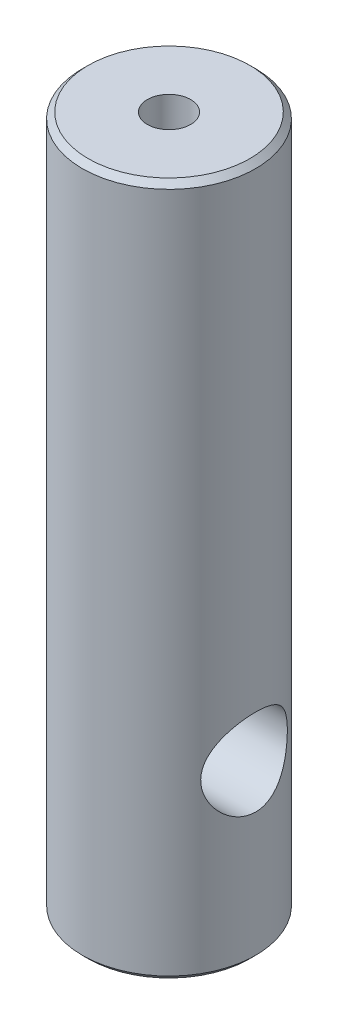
ISO-10303-21;
HEADER;
FILE_DESCRIPTION(('STEP AP214'),'2;1');
FILE_NAME('part.step','',(''),(''),'','','');
FILE_SCHEMA(('AUTOMOTIVE_DESIGN { 1 0 10303 214 1 1 1 1 }'));
ENDSEC;
DATA;
#1=APPLICATION_CONTEXT('core data for automotive mechanical design processes');
#2=APPLICATION_PROTOCOL_DEFINITION('international standard','automotive_design',2000,#1);
#3=PRODUCT_CONTEXT('',#1,'mechanical');
#4=PRODUCT('Part','Part','',(#3));
#5=PRODUCT_RELATED_PRODUCT_CATEGORY('part','',(#4));
#6=PRODUCT_DEFINITION_FORMATION('','',#4);
#7=PRODUCT_DEFINITION_CONTEXT('part definition',#1,'design');
#8=PRODUCT_DEFINITION('design','',#6,#7);
#9=PRODUCT_DEFINITION_SHAPE('','',#8);
#10=(LENGTH_UNIT() NAMED_UNIT(*) SI_UNIT(.MILLI.,.METRE.));
#11=(NAMED_UNIT(*) PLANE_ANGLE_UNIT() SI_UNIT($,.RADIAN.));
#12=(NAMED_UNIT(*) SI_UNIT($,.STERADIAN.) SOLID_ANGLE_UNIT());
#13=UNCERTAINTY_MEASURE_WITH_UNIT(LENGTH_MEASURE(1.E-05),#10,'distance_accuracy_value','');
#14=(GEOMETRIC_REPRESENTATION_CONTEXT(3) GLOBAL_UNCERTAINTY_ASSIGNED_CONTEXT((#13)) GLOBAL_UNIT_ASSIGNED_CONTEXT((#10,
#11,#12)) REPRESENTATION_CONTEXT('',''));
#15=CARTESIAN_POINT('',(0.,0.,0.));
#16=DIRECTION('',(0.,0.,1.));
#17=DIRECTION('',(1.,0.,0.));
#18=AXIS2_PLACEMENT_3D('',#15,#16,#17);
#19=CARTESIAN_POINT('',(0.,76.2,0.));
#20=DIRECTION('',(0.,-1.,0.));
#21=DIRECTION('',(0.,0.,-1.));
#22=AXIS2_PLACEMENT_3D('',#19,#20,#21);
#23=CYLINDRICAL_SURFACE('',#22,9.525);
#24=CARTESIAN_POINT('',(0.,0.635000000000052,0.));
#25=DIRECTION('',(0.,1.,0.));
#26=DIRECTION('',(0.,0.,1.));
#27=AXIS2_PLACEMENT_3D('',#24,#25,#26);
#28=CIRCLE('',#27,9.525);
#29=CARTESIAN_POINT('',(0.,0.635000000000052,9.525));
#30=VERTEX_POINT('',#29);
#31=EDGE_CURVE('E42',#30,#30,#28,.T.);
#32=ORIENTED_EDGE('',*,*,#31,.T.);
#33=EDGE_LOOP('',(#32));
#34=FACE_BOUND('',#33,.T.);
#35=CARTESIAN_POINT('',(0.,75.565,0.));
#36=DIRECTION('',(0.,1.,0.));
#37=DIRECTION('',(0.,0.,1.));
#38=AXIS2_PLACEMENT_3D('',#35,#36,#37);
#39=CIRCLE('',#38,9.525);
#40=CARTESIAN_POINT('',(0.,75.565,9.525));
#41=VERTEX_POINT('',#40);
#42=EDGE_CURVE('E46',#41,#41,#39,.F.);
#43=ORIENTED_EDGE('',*,*,#42,.T.);
#44=EDGE_LOOP('',(#43));
#45=FACE_BOUND('',#44,.T.);
#46=CARTESIAN_POINT('',(-8.24889197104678,19.05,-4.7625));
#47=CARTESIAN_POINT('',(-8.24889272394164,19.1741409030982,-4.76249940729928));
#48=CARTESIAN_POINT('',(-8.25170408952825,19.2982928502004,-4.75763943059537));
#49=CARTESIAN_POINT('',(-8.26284430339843,19.5456383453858,-4.73826449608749));
#50=CARTESIAN_POINT('',(-8.27117572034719,19.6688314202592,-4.72374504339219));
#51=CARTESIAN_POINT('',(-8.29306424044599,19.9134541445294,-4.68521103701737));
#52=CARTESIAN_POINT('',(-8.30662953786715,20.0348807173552,-4.66118159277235));
#53=CARTESIAN_POINT('',(-8.33849424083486,20.2749316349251,-4.60393332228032));
#54=CARTESIAN_POINT('',(-8.35679570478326,20.3935547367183,-4.57071050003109));
#55=CARTESIAN_POINT('',(-8.41767757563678,20.7426984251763,-4.45820926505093));
#56=CARTESIAN_POINT('',(-8.46639036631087,20.9680800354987,-4.36584227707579));
#57=CARTESIAN_POINT('',(-8.57453511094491,21.3999717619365,-4.14940045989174));
#58=CARTESIAN_POINT('',(-8.63396764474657,21.6064808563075,-4.02532391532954));
#59=CARTESIAN_POINT('',(-8.76284791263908,22.0137138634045,-3.73698658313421));
#60=CARTESIAN_POINT('',(-8.83271738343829,22.2125558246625,-3.57025552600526));
#61=CARTESIAN_POINT('',(-8.97122433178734,22.5809832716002,-3.20633353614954));
#62=CARTESIAN_POINT('',(-9.03986117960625,22.7505541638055,-3.00912750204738));
#63=CARTESIAN_POINT('',(-9.13908932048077,22.9849931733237,-2.68636629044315));
#64=CARTESIAN_POINT('',(-9.17251360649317,23.0618472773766,-2.57020878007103));
#65=CARTESIAN_POINT('',(-9.23620349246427,23.205403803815,-2.33097830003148));
#66=CARTESIAN_POINT('',(-9.26647034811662,23.2721102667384,-2.20790810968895));
#67=CARTESIAN_POINT('',(-9.32297018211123,23.3947108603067,-1.95564815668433));
#68=CARTESIAN_POINT('',(-9.34920419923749,23.4506077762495,-1.8264599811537));
#69=CARTESIAN_POINT('',(-9.39686248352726,23.5509730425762,-1.56285911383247));
#70=CARTESIAN_POINT('',(-9.41828726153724,23.5954426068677,-1.42844697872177));
#71=CARTESIAN_POINT('',(-9.45432792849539,23.6696397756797,-1.16519740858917));
#72=CARTESIAN_POINT('',(-9.46931966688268,23.7001908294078,-1.03664325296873));
#73=CARTESIAN_POINT('',(-9.49415396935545,23.7505555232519,-0.776963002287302));
#74=CARTESIAN_POINT('',(-9.50399703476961,23.7703702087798,-0.645837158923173));
#75=CARTESIAN_POINT('',(-9.51824582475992,23.7989934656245,-0.382159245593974));
#76=CARTESIAN_POINT('',(-9.52265417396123,23.8078073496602,-0.249607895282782));
#77=CARTESIAN_POINT('',(-9.52591136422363,23.8143234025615,0.0158324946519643));
#78=CARTESIAN_POINT('',(-9.52476054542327,23.8120262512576,0.148721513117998));
#79=CARTESIAN_POINT('',(-9.51727773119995,23.7970403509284,0.402105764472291));
#80=CARTESIAN_POINT('',(-9.5114066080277,23.7852758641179,0.522670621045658));
#81=CARTESIAN_POINT('',(-9.49520689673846,23.75265197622,0.762297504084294));
#82=CARTESIAN_POINT('',(-9.48487690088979,23.7317897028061,0.881359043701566));
#83=CARTESIAN_POINT('',(-9.4600084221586,23.6812014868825,1.11709538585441));
#84=CARTESIAN_POINT('',(-9.44547134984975,23.6514785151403,1.23377097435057));
#85=CARTESIAN_POINT('',(-9.41253030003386,23.583473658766,1.46405663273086));
#86=CARTESIAN_POINT('',(-9.39412483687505,23.5451884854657,1.57766550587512));
#87=CARTESIAN_POINT('',(-9.33315909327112,23.4168557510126,1.91586173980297));
#88=CARTESIAN_POINT('',(-9.28518547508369,23.313991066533,2.13476891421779));
#89=CARTESIAN_POINT('',(-9.1791264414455,23.0778084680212,2.55262754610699));
#90=CARTESIAN_POINT('',(-9.12103740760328,22.9444796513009,2.75157182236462));
#91=CARTESIAN_POINT('',(-8.99371794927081,22.6366735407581,3.14406030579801));
#92=CARTESIAN_POINT('',(-8.92395340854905,22.4594979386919,3.33531640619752));
#93=CARTESIAN_POINT('',(-8.78462733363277,22.076102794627,3.68669670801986));
#94=CARTESIAN_POINT('',(-8.71506599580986,21.8698611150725,3.84679695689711));
#95=CARTESIAN_POINT('',(-8.61432292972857,21.5348864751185,4.06522723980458));
#96=CARTESIAN_POINT('',(-8.58040455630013,21.415005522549,4.13613898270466));
#97=CARTESIAN_POINT('',(-8.51583950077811,21.1688193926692,4.2674875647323));
#98=CARTESIAN_POINT('',(-8.48519134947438,21.0425171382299,4.32792911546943));
#99=CARTESIAN_POINT('',(-8.42829064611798,20.7842774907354,4.43772127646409));
#100=CARTESIAN_POINT('',(-8.40203655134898,20.6523420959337,4.48707578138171));
#101=CARTESIAN_POINT('',(-8.35498507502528,20.3837946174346,4.57409004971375));
#102=CARTESIAN_POINT('',(-8.334184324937,20.2471854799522,4.61175703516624));
#103=CARTESIAN_POINT('',(-8.30033105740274,19.9812748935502,4.67239107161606));
#104=CARTESIAN_POINT('',(-8.28679731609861,19.8522453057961,4.69628224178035));
#105=CARTESIAN_POINT('',(-8.26567972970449,19.5922327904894,4.73335209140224));
#106=CARTESIAN_POINT('',(-8.25809279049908,19.4612509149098,4.74653634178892));
#107=CARTESIAN_POINT('',(-8.24918359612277,19.1984800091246,4.76200330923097));
#108=CARTESIAN_POINT('',(-8.24785900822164,19.0666912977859,4.76429008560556));
#109=CARTESIAN_POINT('',(-8.25152581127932,18.8034730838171,4.75793657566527));
#110=CARTESIAN_POINT('',(-8.25651677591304,18.6720435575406,4.74929702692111));
#111=CARTESIAN_POINT('',(-8.27171481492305,18.4250764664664,4.72277057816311));
#112=CARTESIAN_POINT('',(-8.28128924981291,18.3093779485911,4.70600273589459));
#113=CARTESIAN_POINT('',(-8.30494741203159,18.07995796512,4.66412284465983));
#114=CARTESIAN_POINT('',(-8.3190325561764,17.9662371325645,4.63900817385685));
#115=CARTESIAN_POINT('',(-8.36742301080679,17.62914618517,4.55152408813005));
#116=CARTESIAN_POINT('',(-8.40787423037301,17.4096861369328,4.47699683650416));
#117=CARTESIAN_POINT('',(-8.50278882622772,16.9763186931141,4.29409140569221));
#118=CARTESIAN_POINT('',(-8.55781440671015,16.763139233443,4.18430528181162));
#119=CARTESIAN_POINT('',(-8.67518529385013,16.3569607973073,3.93519108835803));
#120=CARTESIAN_POINT('',(-8.73753435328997,16.1639722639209,3.79584784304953));
#121=CARTESIAN_POINT('',(-8.87196405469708,15.7782659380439,3.47109765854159));
#122=CARTESIAN_POINT('',(-8.94428069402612,15.5886488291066,3.28209830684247));
#123=CARTESIAN_POINT('',(-9.08372577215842,15.2427789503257,2.87366994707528));
#124=CARTESIAN_POINT('',(-9.15085245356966,15.0865374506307,2.65423070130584));
#125=CARTESIAN_POINT('',(-9.24324496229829,14.8789934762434,2.30289806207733));
#126=CARTESIAN_POINT('',(-9.27299632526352,14.8136018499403,2.18030840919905));
#127=CARTESIAN_POINT('',(-9.32847745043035,14.693496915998,1.9291530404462));
#128=CARTESIAN_POINT('',(-9.35420899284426,14.6387788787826,1.80059000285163));
#129=CARTESIAN_POINT('',(-9.40087915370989,14.5406574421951,1.53844708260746));
#130=CARTESIAN_POINT('',(-9.4218200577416,14.4972486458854,1.40486962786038));
#131=CARTESIAN_POINT('',(-9.45827821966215,14.4222701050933,1.13371049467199));
#132=CARTESIAN_POINT('',(-9.47379612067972,14.3906989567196,0.996129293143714));
#133=CARTESIAN_POINT('',(-9.49775785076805,14.3421782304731,0.730949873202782));
#134=CARTESIAN_POINT('',(-9.50672024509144,14.3241525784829,0.603594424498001));
#135=CARTESIAN_POINT('',(-9.51951815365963,14.2984599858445,0.347590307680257));
#136=CARTESIAN_POINT('',(-9.52335406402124,14.2907922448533,0.218941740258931));
#137=CARTESIAN_POINT('',(-9.52579195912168,14.2859158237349,-0.0385649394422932));
#138=CARTESIAN_POINT('',(-9.52439546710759,14.2887040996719,-0.16742297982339));
#139=CARTESIAN_POINT('',(-9.51641162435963,14.3046950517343,-0.424324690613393));
#140=CARTESIAN_POINT('',(-9.50982441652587,14.3178974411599,-0.55236838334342));
#141=CARTESIAN_POINT('',(-9.49224229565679,14.353334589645,-0.798199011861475));
#142=CARTESIAN_POINT('',(-9.48156800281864,14.3749136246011,-0.916103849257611));
#143=CARTESIAN_POINT('',(-9.45610870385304,14.4267680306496,-1.14954398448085));
#144=CARTESIAN_POINT('',(-9.44132238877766,14.4570461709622,-1.26507851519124));
#145=CARTESIAN_POINT('',(-9.39128133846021,14.5604943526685,-1.60695881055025));
#146=CARTESIAN_POINT('',(-9.35032881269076,14.6463085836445,-1.82878870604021));
#147=CARTESIAN_POINT('',(-9.25477034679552,14.8529442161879,-2.26424000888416));
#148=CARTESIAN_POINT('',(-9.1996553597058,14.9751059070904,-2.47710454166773));
#149=CARTESIAN_POINT('',(-9.08152237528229,15.2493252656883,-2.88023067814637));
#150=CARTESIAN_POINT('',(-9.01850075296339,15.401396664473,-3.07048183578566));
#151=CARTESIAN_POINT('',(-8.88342722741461,15.7486113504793,-3.44287591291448));
#152=CARTESIAN_POINT('',(-8.81110081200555,15.9465350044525,-3.62232759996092));
#153=CARTESIAN_POINT('',(-8.67074486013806,16.3709004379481,-3.94652779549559));
#154=CARTESIAN_POINT('',(-8.60271916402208,16.5973671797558,-4.09124560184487));
#155=CARTESIAN_POINT('',(-8.50907579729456,16.9585192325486,-4.28094082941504));
#156=CARTESIAN_POINT('',(-8.47885685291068,17.084636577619,-4.34031088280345));
#157=CARTESIAN_POINT('',(-8.42284293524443,17.342410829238,-4.44803619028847));
#158=CARTESIAN_POINT('',(-8.39704568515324,17.4740648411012,-4.49639711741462));
#159=CARTESIAN_POINT('',(-8.35096779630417,17.7416535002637,-4.58140792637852));
#160=CARTESIAN_POINT('',(-8.33067298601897,17.8775761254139,-4.61808793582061));
#161=CARTESIAN_POINT('',(-8.29641582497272,18.1528327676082,-4.67935352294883));
#162=CARTESIAN_POINT('',(-8.28244904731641,18.292164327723,-4.70394755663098));
#163=CARTESIAN_POINT('',(-8.26434282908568,18.5346954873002,-4.73566148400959));
#164=CARTESIAN_POINT('',(-8.25856285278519,18.637400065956,-4.74571628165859));
#165=CARTESIAN_POINT('',(-8.25083698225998,18.843400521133,-4.7591360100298));
#166=CARTESIAN_POINT('',(-8.24889134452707,18.9466964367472,-4.76250049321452));
#167=CARTESIAN_POINT('',(-8.24889197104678,19.05,-4.7625));
#168=B_SPLINE_CURVE_WITH_KNOTS('',3,(#46,#47,#48,#49,#50,#51,#52,#53,#54,#55,#56,#57,#58,#59,
#60,#61,#62,#63,#64,#65,#66,#67,#68,#69,#70,#71,#72,#73,#74,#75,#76,#77,#78,#79,#80,#81,#82,#83,
#84,#85,#86,#87,#88,#89,#90,#91,#92,#93,#94,#95,#96,#97,#98,#99,#100,#101,#102,#103,#104,#105,
#106,#107,#108,#109,#110,#111,#112,#113,#114,#115,#116,#117,#118,#119,#120,#121,#122,#123,#124,
#125,#126,#127,#128,#129,#130,#131,#132,#133,#134,#135,#136,#137,#138,#139,#140,#141,#142,#143,
#144,#145,#146,#147,#148,#149,#150,#151,#152,#153,#154,#155,#156,#157,#158,#159,#160,#161,#162,
#163,#164,#165,#166,#167),.UNSPECIFIED.,.T.,.F.,(4,2,2,2,2,2,2,2,2,2,2,2,2,2,2,2,2,2,2,2,2,2,2,
2,2,2,2,2,2,2,2,2,2,2,2,2,2,2,2,2,2,2,2,2,2,2,2,2,2,2,2,2,2,2,2,2,2,2,2,2,4),(0.,
0.372315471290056,0.74480431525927,1.11787871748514,1.49111553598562,2.23280682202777,
2.97453823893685,3.77744614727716,4.58075320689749,5.00998800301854,5.43905143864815,
5.8680041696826,6.29691131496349,6.69531812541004,7.09368613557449,7.49186168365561,
7.8900128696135,8.25342137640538,8.61694470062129,8.98034628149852,9.3438876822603,
10.0802760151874,10.8169283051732,11.6232144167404,12.4301179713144,12.8597106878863,
13.2891095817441,13.7183573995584,14.1473394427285,14.5425345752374,14.9375239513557,
15.3323661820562,15.7271817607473,16.0786628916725,16.4302545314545,17.1329551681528,
17.8682015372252,18.603826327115,19.432180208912,20.2608133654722,20.6865967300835,
21.1121909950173,21.5375817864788,21.9629221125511,22.3492223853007,22.735492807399,
23.1216507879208,23.5077981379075,23.8683853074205,24.2290873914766,24.9498683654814,
25.7014774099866,26.4534323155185,27.2802219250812,28.1077396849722,28.5351353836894,
28.9623103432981,29.388374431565,29.8141399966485,30.1239407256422,30.4337621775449),.UNSPECIFIED.);
#169=CARTESIAN_POINT('',(-8.24889197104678,19.05,-4.7625));
#170=VERTEX_POINT('',#169);
#171=EDGE_CURVE('E52',#170,#170,#168,.T.);
#172=ORIENTED_EDGE('',*,*,#171,.T.);
#173=EDGE_LOOP('',(#172));
#174=FACE_BOUND('',#173,.T.);
#175=CARTESIAN_POINT('',(8.24889197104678,19.05,-4.7625));
#176=CARTESIAN_POINT('',(8.24889272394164,18.9258590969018,-4.76249940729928));
#177=CARTESIAN_POINT('',(8.25170408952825,18.8017071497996,-4.75763943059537));
#178=CARTESIAN_POINT('',(8.26284430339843,18.5543616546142,-4.73826449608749));
#179=CARTESIAN_POINT('',(8.27117572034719,18.4311685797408,-4.72374504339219));
#180=CARTESIAN_POINT('',(8.29306424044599,18.1865458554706,-4.68521103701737));
#181=CARTESIAN_POINT('',(8.30662953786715,18.0651192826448,-4.66118159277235));
#182=CARTESIAN_POINT('',(8.33849424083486,17.8250683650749,-4.60393332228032));
#183=CARTESIAN_POINT('',(8.35679570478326,17.7064452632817,-4.57071050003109));
#184=CARTESIAN_POINT('',(8.41767757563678,17.3573015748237,-4.45820926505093));
#185=CARTESIAN_POINT('',(8.46639036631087,17.1319199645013,-4.36584227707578));
#186=CARTESIAN_POINT('',(8.57453511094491,16.7000282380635,-4.14940045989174));
#187=CARTESIAN_POINT('',(8.63396764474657,16.4935191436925,-4.02532391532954));
#188=CARTESIAN_POINT('',(8.76284791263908,16.0862861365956,-3.73698658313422));
#189=CARTESIAN_POINT('',(8.83271738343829,15.8874441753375,-3.57025552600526));
#190=CARTESIAN_POINT('',(8.97122433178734,15.5190167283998,-3.20633353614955));
#191=CARTESIAN_POINT('',(9.03986117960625,15.3494458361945,-3.00912750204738));
#192=CARTESIAN_POINT('',(9.13908932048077,15.1150068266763,-2.68636629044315));
#193=CARTESIAN_POINT('',(9.17251360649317,15.0381527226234,-2.57020878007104));
#194=CARTESIAN_POINT('',(9.23620349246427,14.894596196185,-2.33097830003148));
#195=CARTESIAN_POINT('',(9.26647034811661,14.8278897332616,-2.20790810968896));
#196=CARTESIAN_POINT('',(9.32297018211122,14.7052891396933,-1.95564815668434));
#197=CARTESIAN_POINT('',(9.34920419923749,14.6493922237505,-1.82645998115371));
#198=CARTESIAN_POINT('',(9.39686248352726,14.5490269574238,-1.56285911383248));
#199=CARTESIAN_POINT('',(9.41828726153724,14.5045573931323,-1.42844697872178));
#200=CARTESIAN_POINT('',(9.45432792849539,14.4303602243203,-1.16519740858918));
#201=CARTESIAN_POINT('',(9.46931966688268,14.3998091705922,-1.03664325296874));
#202=CARTESIAN_POINT('',(9.49415396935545,14.3494444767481,-0.776963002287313));
#203=CARTESIAN_POINT('',(9.50399703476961,14.3296297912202,-0.645837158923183));
#204=CARTESIAN_POINT('',(9.51824582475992,14.3010065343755,-0.382159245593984));
#205=CARTESIAN_POINT('',(9.52265417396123,14.2921926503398,-0.249607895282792));
#206=CARTESIAN_POINT('',(9.52591136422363,14.2856765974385,0.0158324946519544));
#207=CARTESIAN_POINT('',(9.52476054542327,14.2879737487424,0.148721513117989));
#208=CARTESIAN_POINT('',(9.51727773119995,14.3029596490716,0.402105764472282));
#209=CARTESIAN_POINT('',(9.5114066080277,14.314724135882,0.522670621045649));
#210=CARTESIAN_POINT('',(9.49520689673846,14.34734802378,0.762297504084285));
#211=CARTESIAN_POINT('',(9.48487690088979,14.3682102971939,0.881359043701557));
#212=CARTESIAN_POINT('',(9.4600084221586,14.4187985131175,1.1170953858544));
#213=CARTESIAN_POINT('',(9.44547134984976,14.4485214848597,1.23377097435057));
#214=CARTESIAN_POINT('',(9.41253030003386,14.516526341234,1.46405663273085));
#215=CARTESIAN_POINT('',(9.39412483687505,14.5548115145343,1.57766550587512));
#216=CARTESIAN_POINT('',(9.33315909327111,14.6831442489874,1.91586173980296));
#217=CARTESIAN_POINT('',(9.28518547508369,14.786008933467,2.13476891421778));
#218=CARTESIAN_POINT('',(9.1791264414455,15.0221915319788,2.55262754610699));
#219=CARTESIAN_POINT('',(9.12103740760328,15.1555203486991,2.75157182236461));
#220=CARTESIAN_POINT('',(8.99371794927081,15.4633264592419,3.14406030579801));
#221=CARTESIAN_POINT('',(8.92395340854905,15.6405020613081,3.33531640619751));
#222=CARTESIAN_POINT('',(8.78462733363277,16.023897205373,3.68669670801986));
#223=CARTESIAN_POINT('',(8.71506599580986,16.2301388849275,3.84679695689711));
#224=CARTESIAN_POINT('',(8.61432292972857,16.5651135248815,4.06522723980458));
#225=CARTESIAN_POINT('',(8.58040455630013,16.684994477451,4.13613898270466));
#226=CARTESIAN_POINT('',(8.51583950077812,16.9311806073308,4.2674875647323));
#227=CARTESIAN_POINT('',(8.48519134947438,17.0574828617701,4.32792911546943));
#228=CARTESIAN_POINT('',(8.42829064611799,17.3157225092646,4.43772127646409));
#229=CARTESIAN_POINT('',(8.40203655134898,17.4476579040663,4.48707578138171));
#230=CARTESIAN_POINT('',(8.35498507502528,17.7162053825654,4.57409004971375));
#231=CARTESIAN_POINT('',(8.33418432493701,17.8528145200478,4.61175703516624));
#232=CARTESIAN_POINT('',(8.30033105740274,18.1187251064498,4.67239107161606));
#233=CARTESIAN_POINT('',(8.28679731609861,18.2477546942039,4.69628224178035));
#234=CARTESIAN_POINT('',(8.26567972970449,18.5077672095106,4.73335209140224));
#235=CARTESIAN_POINT('',(8.25809279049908,18.6387490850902,4.74653634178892));
#236=CARTESIAN_POINT('',(8.24918359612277,18.9015199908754,4.76200330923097));
#237=CARTESIAN_POINT('',(8.24785900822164,19.033308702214,4.76429008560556));
#238=CARTESIAN_POINT('',(8.25152581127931,19.2965269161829,4.75793657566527));
#239=CARTESIAN_POINT('',(8.25651677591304,19.4279564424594,4.74929702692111));
#240=CARTESIAN_POINT('',(8.27171481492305,19.6749235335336,4.72277057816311));
#241=CARTESIAN_POINT('',(8.28128924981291,19.7906220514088,4.70600273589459));
#242=CARTESIAN_POINT('',(8.30494741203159,20.02004203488,4.66412284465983));
#243=CARTESIAN_POINT('',(8.3190325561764,20.1337628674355,4.63900817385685));
#244=CARTESIAN_POINT('',(8.36742301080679,20.47085381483,4.55152408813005));
#245=CARTESIAN_POINT('',(8.40787423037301,20.6903138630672,4.47699683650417));
#246=CARTESIAN_POINT('',(8.50278882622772,21.1236813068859,4.29409140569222));
#247=CARTESIAN_POINT('',(8.55781440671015,21.336860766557,4.18430528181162));
#248=CARTESIAN_POINT('',(8.67518529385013,21.7430392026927,3.93519108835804));
#249=CARTESIAN_POINT('',(8.73753435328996,21.9360277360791,3.79584784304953));
#250=CARTESIAN_POINT('',(8.87196405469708,22.3217340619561,3.4710976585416));
#251=CARTESIAN_POINT('',(8.94428069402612,22.5113511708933,3.28209830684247));
#252=CARTESIAN_POINT('',(9.08372577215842,22.8572210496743,2.87366994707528));
#253=CARTESIAN_POINT('',(9.15085245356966,23.0134625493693,2.65423070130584));
#254=CARTESIAN_POINT('',(9.24324496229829,23.2210065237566,2.30289806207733));
#255=CARTESIAN_POINT('',(9.27299632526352,23.2863981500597,2.18030840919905));
#256=CARTESIAN_POINT('',(9.32847745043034,23.406503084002,1.92915304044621));
#257=CARTESIAN_POINT('',(9.35420899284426,23.4612211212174,1.80059000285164));
#258=CARTESIAN_POINT('',(9.40087915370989,23.5593425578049,1.53844708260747));
#259=CARTESIAN_POINT('',(9.4218200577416,23.6027513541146,1.40486962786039));
#260=CARTESIAN_POINT('',(9.45827821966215,23.6777298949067,1.13371049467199));
#261=CARTESIAN_POINT('',(9.47379612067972,23.7093010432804,0.996129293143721));
#262=CARTESIAN_POINT('',(9.49775785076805,23.7578217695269,0.730949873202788));
#263=CARTESIAN_POINT('',(9.50672024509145,23.7758474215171,0.603594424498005));
#264=CARTESIAN_POINT('',(9.51951815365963,23.8015400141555,0.34759030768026));
#265=CARTESIAN_POINT('',(9.52335406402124,23.8092077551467,0.218941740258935));
#266=CARTESIAN_POINT('',(9.52579195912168,23.8140841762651,-0.03856493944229));
#267=CARTESIAN_POINT('',(9.52439546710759,23.8112959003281,-0.167422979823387));
#268=CARTESIAN_POINT('',(9.51641162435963,23.7953049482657,-0.424324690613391));
#269=CARTESIAN_POINT('',(9.50982441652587,23.7821025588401,-0.552368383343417));
#270=CARTESIAN_POINT('',(9.49224229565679,23.746665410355,-0.79819901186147));
#271=CARTESIAN_POINT('',(9.48156800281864,23.7250863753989,-0.916103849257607));
#272=CARTESIAN_POINT('',(9.45610870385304,23.6732319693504,-1.14954398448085));
#273=CARTESIAN_POINT('',(9.44132238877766,23.6429538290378,-1.26507851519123));
#274=CARTESIAN_POINT('',(9.39128133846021,23.5395056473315,-1.60695881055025));
#275=CARTESIAN_POINT('',(9.35032881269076,23.4536914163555,-1.82878870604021));
#276=CARTESIAN_POINT('',(9.25477034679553,23.2470557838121,-2.26424000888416));
#277=CARTESIAN_POINT('',(9.1996553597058,23.1248940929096,-2.47710454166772));
#278=CARTESIAN_POINT('',(9.08152237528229,22.8506747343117,-2.88023067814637));
#279=CARTESIAN_POINT('',(9.01850075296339,22.698603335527,-3.07048183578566));
#280=CARTESIAN_POINT('',(8.88342722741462,22.3513886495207,-3.44287591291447));
#281=CARTESIAN_POINT('',(8.81110081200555,22.1534649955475,-3.62232759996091));
#282=CARTESIAN_POINT('',(8.67074486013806,21.7290995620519,-3.94652779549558));
#283=CARTESIAN_POINT('',(8.60271916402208,21.5026328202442,-4.09124560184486));
#284=CARTESIAN_POINT('',(8.50907579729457,21.1414807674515,-4.28094082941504));
#285=CARTESIAN_POINT('',(8.47885685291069,21.015363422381,-4.34031088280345));
#286=CARTESIAN_POINT('',(8.42284293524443,20.757589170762,-4.44803619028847));
#287=CARTESIAN_POINT('',(8.39704568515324,20.6259351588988,-4.49639711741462));
#288=CARTESIAN_POINT('',(8.35096779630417,20.3583464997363,-4.58140792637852));
#289=CARTESIAN_POINT('',(8.33067298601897,20.2224238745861,-4.61808793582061));
#290=CARTESIAN_POINT('',(8.29641582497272,19.9471672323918,-4.67935352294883));
#291=CARTESIAN_POINT('',(8.28244904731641,19.807835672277,-4.70394755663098));
#292=CARTESIAN_POINT('',(8.26434282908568,19.5653045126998,-4.73566148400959));
#293=CARTESIAN_POINT('',(8.25856285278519,19.462599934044,-4.74571628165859));
#294=CARTESIAN_POINT('',(8.25083698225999,19.256599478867,-4.7591360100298));
#295=CARTESIAN_POINT('',(8.24889134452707,19.1533035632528,-4.76250049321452));
#296=CARTESIAN_POINT('',(8.24889197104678,19.05,-4.7625));
#297=B_SPLINE_CURVE_WITH_KNOTS('',3,(#175,#176,#177,#178,#179,#180,#181,#182,#183,#184,#185,
#186,#187,#188,#189,#190,#191,#192,#193,#194,#195,#196,#197,#198,#199,#200,#201,#202,#203,#204,
#205,#206,#207,#208,#209,#210,#211,#212,#213,#214,#215,#216,#217,#218,#219,#220,#221,#222,#223,
#224,#225,#226,#227,#228,#229,#230,#231,#232,#233,#234,#235,#236,#237,#238,#239,#240,#241,#242,
#243,#244,#245,#246,#247,#248,#249,#250,#251,#252,#253,#254,#255,#256,#257,#258,#259,#260,#261,
#262,#263,#264,#265,#266,#267,#268,#269,#270,#271,#272,#273,#274,#275,#276,#277,#278,#279,#280,
#281,#282,#283,#284,#285,#286,#287,#288,#289,#290,#291,#292,#293,#294,#295,#296),.UNSPECIFIED.,
.T.,.F.,(4,2,2,2,2,2,2,2,2,2,2,2,2,2,2,2,2,2,2,2,2,2,2,2,2,2,2,2,2,2,2,2,2,2,2,2,2,2,2,2,2,2,2,
2,2,2,2,2,2,2,2,2,2,2,2,2,2,2,2,2,4),(0.,0.372315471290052,0.74480431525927,1.11787871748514,
1.49111553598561,2.23280682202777,2.97453823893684,3.77744614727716,4.58075320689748,
5.00998800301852,5.43905143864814,5.86800416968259,6.29691131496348,6.69531812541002,
7.09368613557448,7.49186168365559,7.89001286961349,8.25342137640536,8.61694470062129,
8.98034628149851,9.3438876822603,10.0802760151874,10.8169283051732,11.6232144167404,
12.4301179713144,12.8597106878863,13.289109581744,13.7183573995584,14.1473394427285,
14.5425345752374,14.9375239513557,15.3323661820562,15.7271817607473,16.0786628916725,
16.4302545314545,17.1329551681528,17.8682015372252,18.603826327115,19.432180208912,
20.2608133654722,20.6865967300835,21.1121909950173,21.5375817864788,21.9629221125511,
22.3492223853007,22.7354928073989,23.1216507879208,23.5077981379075,23.8683853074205,
24.2290873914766,24.9498683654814,25.7014774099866,26.4534323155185,27.2802219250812,
28.1077396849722,28.5351353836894,28.9623103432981,29.388374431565,29.8141399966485,
30.1239407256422,30.4337621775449),.UNSPECIFIED.);
#298=CARTESIAN_POINT('',(8.24889197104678,19.05,-4.7625));
#299=VERTEX_POINT('',#298);
#300=EDGE_CURVE('E60',#299,#299,#297,.T.);
#301=ORIENTED_EDGE('',*,*,#300,.T.);
#302=EDGE_LOOP('',(#301));
#303=FACE_BOUND('',#302,.T.);
#304=ADVANCED_FACE('F31',(#34,#45,#174,#303),#23,.T.);
#305=CARTESIAN_POINT('',(0.,76.2,0.));
#306=DIRECTION('',(0.,1.,0.));
#307=DIRECTION('',(0.,0.,1.));
#308=AXIS2_PLACEMENT_3D('',#305,#306,#307);
#309=PLANE('',#308);
#310=CARTESIAN_POINT('',(0.,76.2,0.));
#311=DIRECTION('',(0.,1.,0.));
#312=DIRECTION('',(0.,0.,1.));
#313=AXIS2_PLACEMENT_3D('',#310,#311,#312);
#314=CIRCLE('',#313,8.89000000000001);
#315=CARTESIAN_POINT('',(0.,76.2,8.89000000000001));
#316=VERTEX_POINT('',#315);
#317=EDGE_CURVE('E10',#316,#316,#314,.T.);
#318=ORIENTED_EDGE('',*,*,#317,.T.);
#319=EDGE_LOOP('',(#318));
#320=FACE_BOUND('',#319,.T.);
#321=CARTESIAN_POINT('',(0.,76.2,0.));
#322=DIRECTION('',(0.,1.,0.));
#323=DIRECTION('',(0.,0.,1.));
#324=AXIS2_PLACEMENT_3D('',#321,#322,#323);
#325=CIRCLE('',#324,2.38125);
#326=CARTESIAN_POINT('',(0.,76.2,2.38125));
#327=VERTEX_POINT('',#326);
#328=EDGE_CURVE('E59',#327,#327,#325,.T.);
#329=ORIENTED_EDGE('',*,*,#328,.F.);
#330=EDGE_LOOP('',(#329));
#331=FACE_BOUND('',#330,.T.);
#332=ADVANCED_FACE('F82',(#320,#331),#309,.T.);
#333=CARTESIAN_POINT('',(0.,0.,0.));
#334=DIRECTION('',(0.,1.,0.));
#335=DIRECTION('',(0.,0.,1.));
#336=AXIS2_PLACEMENT_3D('',#333,#334,#335);
#337=PLANE('',#336);
#338=CARTESIAN_POINT('',(0.,0.,0.));
#339=DIRECTION('',(0.,1.,0.));
#340=DIRECTION('',(0.,0.,1.));
#341=AXIS2_PLACEMENT_3D('',#338,#339,#340);
#342=CIRCLE('',#341,8.88999999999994);
#343=CARTESIAN_POINT('',(0.,0.,8.88999999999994));
#344=VERTEX_POINT('',#343);
#345=EDGE_CURVE('E38',#344,#344,#342,.F.);
#346=ORIENTED_EDGE('',*,*,#345,.T.);
#347=EDGE_LOOP('',(#346));
#348=FACE_BOUND('',#347,.T.);
#349=ADVANCED_FACE('F80',(#348),#337,.F.);
#350=CARTESIAN_POINT('',(0.,38.1,0.));
#351=DIRECTION('',(0.,1.,0.));
#352=DIRECTION('',(0.,0.,1.));
#353=AXIS2_PLACEMENT_3D('',#350,#351,#352);
#354=CYLINDRICAL_SURFACE('',#353,2.38125);
#355=CARTESIAN_POINT('',(0.,38.1,0.));
#356=DIRECTION('',(0.,1.,0.));
#357=DIRECTION('',(0.,0.,1.));
#358=AXIS2_PLACEMENT_3D('',#355,#356,#357);
#359=CIRCLE('',#358,2.38125);
#360=CARTESIAN_POINT('',(0.,38.1,2.38125));
#361=VERTEX_POINT('',#360);
#362=EDGE_CURVE('E51',#361,#361,#359,.T.);
#363=CARTESIAN_POINT('',(0.,38.1,2.38125));
#364=CARTESIAN_POINT('',(0.,38.496875,2.38125));
#365=CARTESIAN_POINT('',(0.,38.89375,2.38125));
#366=CARTESIAN_POINT('',(0.,39.6875,2.38125));
#367=CARTESIAN_POINT('',(0.,40.084375,2.38125));
#368=CARTESIAN_POINT('',(0.,40.878125,2.38125));
#369=CARTESIAN_POINT('',(0.,41.275,2.38125));
#370=CARTESIAN_POINT('',(0.,42.06875,2.38125));
#371=CARTESIAN_POINT('',(0.,42.465625,2.38125));
#372=CARTESIAN_POINT('',(0.,43.259375,2.38125));
#373=CARTESIAN_POINT('',(0.,43.65625,2.38125));
#374=CARTESIAN_POINT('',(0.,44.45,2.38125));
#375=CARTESIAN_POINT('',(0.,44.846875,2.38125));
#376=CARTESIAN_POINT('',(0.,45.640625,2.38125));
#377=CARTESIAN_POINT('',(0.,46.0375,2.38125));
#378=CARTESIAN_POINT('',(0.,46.83125,2.38125));
#379=CARTESIAN_POINT('',(0.,47.228125,2.38125));
#380=CARTESIAN_POINT('',(0.,48.021875,2.38125));
#381=CARTESIAN_POINT('',(0.,48.41875,2.38125));
#382=CARTESIAN_POINT('',(0.,49.2125,2.38125));
#383=CARTESIAN_POINT('',(0.,49.609375,2.38125));
#384=CARTESIAN_POINT('',(0.,50.403125,2.38125));
#385=CARTESIAN_POINT('',(0.,50.8,2.38125));
#386=CARTESIAN_POINT('',(0.,51.59375,2.38125));
#387=CARTESIAN_POINT('',(0.,51.990625,2.38125));
#388=CARTESIAN_POINT('',(0.,52.784375,2.38125));
#389=CARTESIAN_POINT('',(0.,53.18125,2.38125));
#390=CARTESIAN_POINT('',(0.,53.975,2.38125));
#391=CARTESIAN_POINT('',(0.,54.371875,2.38125));
#392=CARTESIAN_POINT('',(0.,55.165625,2.38125));
#393=CARTESIAN_POINT('',(0.,55.5625,2.38125));
#394=CARTESIAN_POINT('',(0.,56.35625,2.38125));
#395=CARTESIAN_POINT('',(0.,56.753125,2.38125));
#396=CARTESIAN_POINT('',(0.,57.546875,2.38125));
#397=CARTESIAN_POINT('',(0.,57.94375,2.38125));
#398=CARTESIAN_POINT('',(0.,58.7375,2.38125));
#399=CARTESIAN_POINT('',(0.,59.134375,2.38125));
#400=CARTESIAN_POINT('',(0.,59.928125,2.38125));
#401=CARTESIAN_POINT('',(0.,60.325,2.38125));
#402=CARTESIAN_POINT('',(0.,61.11875,2.38125));
#403=CARTESIAN_POINT('',(0.,61.515625,2.38125));
#404=CARTESIAN_POINT('',(0.,62.309375,2.38125));
#405=CARTESIAN_POINT('',(0.,62.70625,2.38125));
#406=CARTESIAN_POINT('',(0.,63.5,2.38125));
#407=CARTESIAN_POINT('',(0.,63.896875,2.38125));
#408=CARTESIAN_POINT('',(0.,64.690625,2.38125));
#409=CARTESIAN_POINT('',(0.,65.0875,2.38125));
#410=CARTESIAN_POINT('',(0.,65.88125,2.38125));
#411=CARTESIAN_POINT('',(0.,66.278125,2.38125));
#412=CARTESIAN_POINT('',(0.,67.071875,2.38125));
#413=CARTESIAN_POINT('',(0.,67.46875,2.38125));
#414=CARTESIAN_POINT('',(0.,68.2625,2.38125));
#415=CARTESIAN_POINT('',(0.,68.659375,2.38125));
#416=CARTESIAN_POINT('',(0.,69.453125,2.38125));
#417=CARTESIAN_POINT('',(0.,69.85,2.38125));
#418=CARTESIAN_POINT('',(0.,70.64375,2.38125));
#419=CARTESIAN_POINT('',(0.,71.040625,2.38125));
#420=CARTESIAN_POINT('',(0.,71.834375,2.38125));
#421=CARTESIAN_POINT('',(0.,72.23125,2.38125));
#422=CARTESIAN_POINT('',(0.,73.025,2.38125));
#423=CARTESIAN_POINT('',(0.,73.421875,2.38125));
#424=CARTESIAN_POINT('',(0.,74.215625,2.38125));
#425=CARTESIAN_POINT('',(0.,74.6125,2.38125));
#426=CARTESIAN_POINT('',(0.,75.40625,2.38125));
#427=CARTESIAN_POINT('',(0.,75.803125,2.38125));
#428=CARTESIAN_POINT('',(0.,76.2,2.38125));
#429=B_SPLINE_CURVE_WITH_KNOTS('',3,(#363,#364,#365,#366,#367,#368,#369,#370,#371,#372,#373,
#374,#375,#376,#377,#378,#379,#380,#381,#382,#383,#384,#385,#386,#387,#388,#389,#390,#391,#392,
#393,#394,#395,#396,#397,#398,#399,#400,#401,#402,#403,#404,#405,#406,#407,#408,#409,#410,#411,
#412,#413,#414,#415,#416,#417,#418,#419,#420,#421,#422,#423,#424,#425,#426,#427,#428),
.UNSPECIFIED.,.F.,.F.,(4,2,2,2,2,2,2,2,2,2,2,2,2,2,2,2,2,2,2,2,2,2,2,2,2,2,2,2,2,2,2,2,4),(0.,
1.19062499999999,2.38124999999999,3.571875,4.7625,5.953125,7.14375,8.334375,9.525,10.715625,
11.90625,13.096875,14.2875,15.478125,16.66875,17.859375,19.05,20.240625,21.43125,22.621875,
23.8125,25.003125,26.19375,27.384375,28.575,29.765625,30.95625,32.146875,33.3375,34.528125,
35.71875,36.909375,38.1),.UNSPECIFIED.);
#430=EDGE_CURVE('BSEAM76',#361,#327,#429,.T.);
#431=ORIENTED_EDGE('',*,*,#362,.F.);
#432=ORIENTED_EDGE('',*,*,#328,.T.);
#433=ORIENTED_EDGE('',*,*,#430,.T.);
#434=ORIENTED_EDGE('',*,*,#430,.F.);
#435=EDGE_LOOP('',(#431,#433,#432,#434));
#436=FACE_BOUND('',#435,.T.);
#437=ADVANCED_FACE('F76',(#436),#354,.F.);
#438=CARTESIAN_POINT('',(0.,38.1,0.));
#439=DIRECTION('',(0.,1.,0.));
#440=DIRECTION('',(0.,0.,1.));
#441=AXIS2_PLACEMENT_3D('',#438,#439,#440);
#442=PLANE('',#441);
#443=ORIENTED_EDGE('',*,*,#362,.T.);
#444=EDGE_LOOP('',(#443));
#445=FACE_BOUND('',#444,.T.);
#446=ADVANCED_FACE('F71',(#445),#442,.T.);
#447=CARTESIAN_POINT('',(-19.05,19.05,0.));
#448=DIRECTION('',(1.,0.,0.));
#449=DIRECTION('',(0.,0.,-1.));
#450=AXIS2_PLACEMENT_3D('',#447,#448,#449);
#451=CYLINDRICAL_SURFACE('',#450,4.7625);
#452=ORIENTED_EDGE('',*,*,#300,.F.);
#453=EDGE_LOOP('',(#452));
#454=FACE_BOUND('',#453,.T.);
#455=ORIENTED_EDGE('',*,*,#171,.F.);
#456=EDGE_LOOP('',(#455));
#457=FACE_BOUND('',#456,.T.);
#458=ADVANCED_FACE('F66',(#454,#457),#451,.F.);
#459=CARTESIAN_POINT('',(0.,0.635000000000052,0.));
#460=DIRECTION('',(0.,1.,0.));
#461=DIRECTION('',(0.,0.,1.));
#462=AXIS2_PLACEMENT_3D('',#459,#460,#461);
#463=CONICAL_SURFACE('',#462,9.525,0.785398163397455);
#464=ORIENTED_EDGE('',*,*,#345,.F.);
#465=EDGE_LOOP('',(#464));
#466=FACE_BOUND('',#465,.T.);
#467=ORIENTED_EDGE('',*,*,#31,.F.);
#468=EDGE_LOOP('',(#467));
#469=FACE_BOUND('',#468,.T.);
#470=ADVANCED_FACE('F70',(#466,#469),#463,.T.);
#471=CARTESIAN_POINT('',(0.,76.2,0.));
#472=DIRECTION('',(0.,-1.,0.));
#473=DIRECTION('',(0.,0.,-1.));
#474=AXIS2_PLACEMENT_3D('',#471,#472,#473);
#475=CONICAL_SURFACE('',#474,8.89000000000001,0.785398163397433);
#476=ORIENTED_EDGE('',*,*,#42,.F.);
#477=EDGE_LOOP('',(#476));
#478=FACE_BOUND('',#477,.T.);
#479=ORIENTED_EDGE('',*,*,#317,.F.);
#480=EDGE_LOOP('',(#479));
#481=FACE_BOUND('',#480,.T.);
#482=ADVANCED_FACE('F33',(#478,#481),#475,.T.);
#483=CLOSED_SHELL('',(#304,#332,#349,#437,#446,#458,#470,#482));
#484=MANIFOLD_SOLID_BREP('B2',#483);
#485=ADVANCED_BREP_SHAPE_REPRESENTATION('',(#18,#484),#14);
#486=SHAPE_DEFINITION_REPRESENTATION(#9,#485);
ENDSEC;
END-ISO-10303-21;
